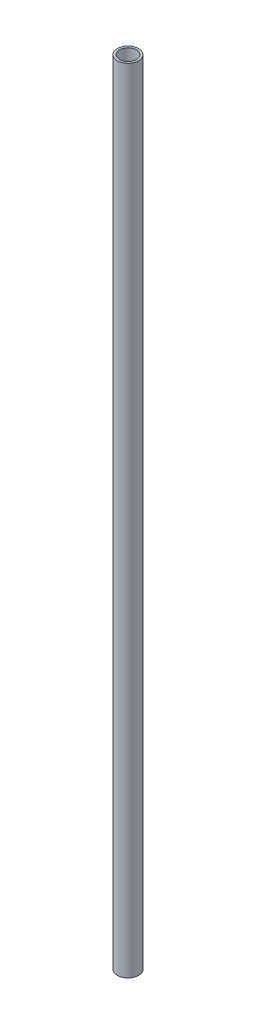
ISO-10303-21;
HEADER;
FILE_DESCRIPTION(('STEP AP214'),'2;1');
FILE_NAME('part.step','',(''),(''),'','','');
FILE_SCHEMA(('AUTOMOTIVE_DESIGN { 1 0 10303 214 1 1 1 1 }'));
ENDSEC;
DATA;
#1=APPLICATION_CONTEXT('core data for automotive mechanical design processes');
#2=APPLICATION_PROTOCOL_DEFINITION('international standard','automotive_design',2000,#1);
#3=PRODUCT_CONTEXT('',#1,'mechanical');
#4=PRODUCT('Part','Part','',(#3));
#5=PRODUCT_RELATED_PRODUCT_CATEGORY('part','',(#4));
#6=PRODUCT_DEFINITION_FORMATION('','',#4);
#7=PRODUCT_DEFINITION_CONTEXT('part definition',#1,'design');
#8=PRODUCT_DEFINITION('design','',#6,#7);
#9=PRODUCT_DEFINITION_SHAPE('','',#8);
#10=(LENGTH_UNIT() NAMED_UNIT(*) SI_UNIT(.MILLI.,.METRE.));
#11=(NAMED_UNIT(*) PLANE_ANGLE_UNIT() SI_UNIT($,.RADIAN.));
#12=(NAMED_UNIT(*) SI_UNIT($,.STERADIAN.) SOLID_ANGLE_UNIT());
#13=UNCERTAINTY_MEASURE_WITH_UNIT(LENGTH_MEASURE(1.E-05),#10,'distance_accuracy_value','');
#14=(GEOMETRIC_REPRESENTATION_CONTEXT(3) GLOBAL_UNCERTAINTY_ASSIGNED_CONTEXT((#13)) GLOBAL_UNIT_ASSIGNED_CONTEXT((#10,
#11,#12)) REPRESENTATION_CONTEXT('',''));
#15=CARTESIAN_POINT('',(0.,0.,0.));
#16=DIRECTION('',(0.,0.,1.));
#17=DIRECTION('',(1.,0.,0.));
#18=AXIS2_PLACEMENT_3D('',#15,#16,#17);
#19=CARTESIAN_POINT('',(0.,187.,0.));
#20=DIRECTION('',(0.,1.,0.));
#21=DIRECTION('',(0.,0.,1.));
#22=AXIS2_PLACEMENT_3D('',#19,#20,#21);
#23=PLANE('',#22);
#24=CARTESIAN_POINT('',(0.,187.,0.));
#25=DIRECTION('',(0.,1.,0.));
#26=DIRECTION('',(0.,0.,1.));
#27=AXIS2_PLACEMENT_3D('',#24,#25,#26);
#28=CIRCLE('',#27,2.5);
#29=CARTESIAN_POINT('',(0.,187.,2.5));
#30=VERTEX_POINT('',#29);
#31=EDGE_CURVE('E10',#30,#30,#28,.T.);
#32=ORIENTED_EDGE('',*,*,#31,.T.);
#33=EDGE_LOOP('',(#32));
#34=FACE_BOUND('',#33,.T.);
#35=CARTESIAN_POINT('',(0.,187.,0.));
#36=DIRECTION('',(0.,1.,0.));
#37=DIRECTION('',(0.,0.,1.));
#38=AXIS2_PLACEMENT_3D('',#35,#36,#37);
#39=CIRCLE('',#38,2.);
#40=CARTESIAN_POINT('',(0.,187.,2.));
#41=VERTEX_POINT('',#40);
#42=EDGE_CURVE('E42',#41,#41,#39,.T.);
#43=ORIENTED_EDGE('',*,*,#42,.F.);
#44=EDGE_LOOP('',(#43));
#45=FACE_BOUND('',#44,.T.);
#46=ADVANCED_FACE('F31',(#34,#45),#23,.T.);
#47=CARTESIAN_POINT('',(0.,0.,0.));
#48=DIRECTION('',(0.,1.,0.));
#49=DIRECTION('',(0.,0.,1.));
#50=AXIS2_PLACEMENT_3D('',#47,#48,#49);
#51=PLANE('',#50);
#52=CARTESIAN_POINT('',(0.,0.,0.));
#53=DIRECTION('',(0.,1.,0.));
#54=DIRECTION('',(0.,0.,1.));
#55=AXIS2_PLACEMENT_3D('',#52,#53,#54);
#56=CIRCLE('',#55,2.5);
#57=CARTESIAN_POINT('',(0.,0.,2.5));
#58=VERTEX_POINT('',#57);
#59=EDGE_CURVE('E35',#58,#58,#56,.T.);
#60=ORIENTED_EDGE('',*,*,#59,.F.);
#61=EDGE_LOOP('',(#60));
#62=FACE_BOUND('',#61,.T.);
#63=CARTESIAN_POINT('',(0.,0.,0.));
#64=DIRECTION('',(0.,1.,0.));
#65=DIRECTION('',(0.,0.,1.));
#66=AXIS2_PLACEMENT_3D('',#63,#64,#65);
#67=CIRCLE('',#66,2.);
#68=CARTESIAN_POINT('',(0.,0.,2.));
#69=VERTEX_POINT('',#68);
#70=EDGE_CURVE('E44',#69,#69,#67,.T.);
#71=ORIENTED_EDGE('',*,*,#70,.T.);
#72=EDGE_LOOP('',(#71));
#73=FACE_BOUND('',#72,.T.);
#74=ADVANCED_FACE('F54',(#62,#73),#51,.F.);
#75=CARTESIAN_POINT('',(0.,187.,0.));
#76=DIRECTION('',(0.,-1.,0.));
#77=DIRECTION('',(0.,0.,-1.));
#78=AXIS2_PLACEMENT_3D('',#75,#76,#77);
#79=CYLINDRICAL_SURFACE('',#78,2.5);
#80=ORIENTED_EDGE('',*,*,#31,.F.);
#81=EDGE_LOOP('',(#80));
#82=FACE_BOUND('',#81,.T.);
#83=ORIENTED_EDGE('',*,*,#59,.T.);
#84=EDGE_LOOP('',(#83));
#85=FACE_BOUND('',#84,.T.);
#86=ADVANCED_FACE('F33',(#82,#85),#79,.T.);
#87=CARTESIAN_POINT('',(0.,187.,0.));
#88=DIRECTION('',(0.,-1.,0.));
#89=DIRECTION('',(0.,0.,-1.));
#90=AXIS2_PLACEMENT_3D('',#87,#88,#89);
#91=CYLINDRICAL_SURFACE('',#90,2.);
#92=ORIENTED_EDGE('',*,*,#42,.T.);
#93=EDGE_LOOP('',(#92));
#94=FACE_BOUND('',#93,.T.);
#95=ORIENTED_EDGE('',*,*,#70,.F.);
#96=EDGE_LOOP('',(#95));
#97=FACE_BOUND('',#96,.T.);
#98=ADVANCED_FACE('F50',(#94,#97),#91,.F.);
#99=CLOSED_SHELL('',(#46,#74,#86,#98));
#100=MANIFOLD_SOLID_BREP('B2',#99);
#101=ADVANCED_BREP_SHAPE_REPRESENTATION('',(#18,#100),#14);
#102=SHAPE_DEFINITION_REPRESENTATION(#9,#101);
ENDSEC;
END-ISO-10303-21;
